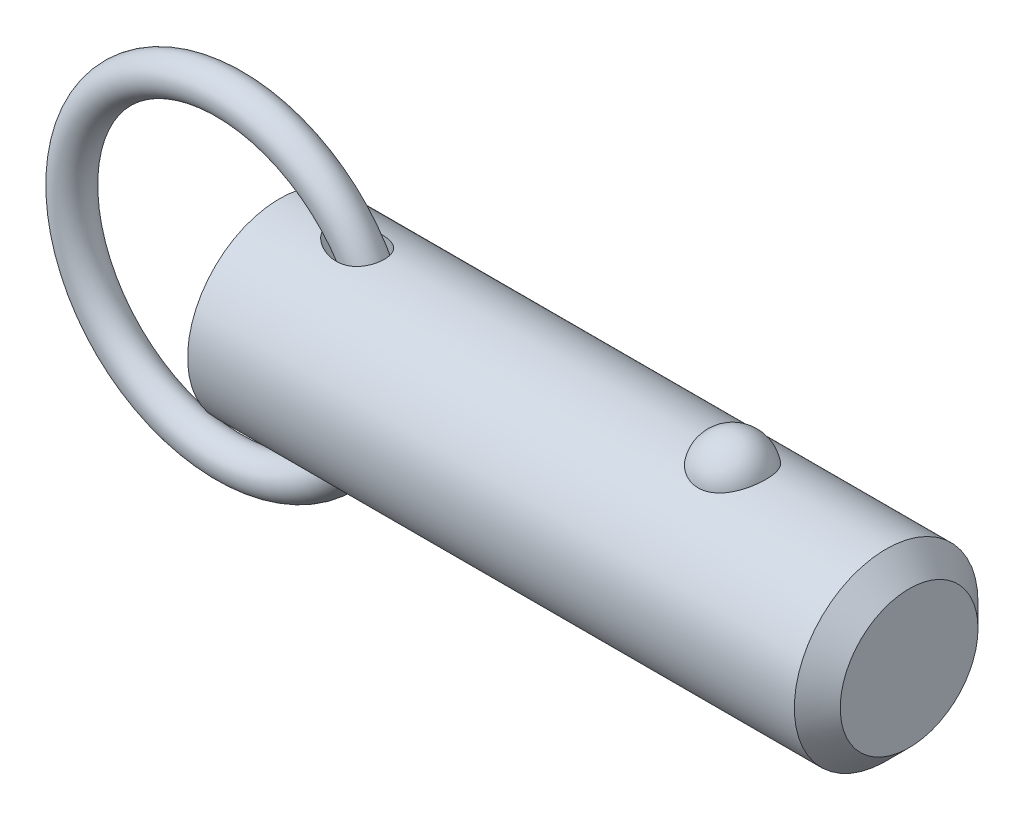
ISO-10303-21;
HEADER;
FILE_DESCRIPTION(('STEP AP214'),'2;1');
FILE_NAME('part.step','',(''),(''),'','','');
FILE_SCHEMA(('AUTOMOTIVE_DESIGN { 1 0 10303 214 1 1 1 1 }'));
ENDSEC;
DATA;
#1=APPLICATION_CONTEXT('core data for automotive mechanical design processes');
#2=APPLICATION_PROTOCOL_DEFINITION('international standard','automotive_design',2000,#1);
#3=PRODUCT_CONTEXT('',#1,'mechanical');
#4=PRODUCT('Part','Part','',(#3));
#5=PRODUCT_RELATED_PRODUCT_CATEGORY('part','',(#4));
#6=PRODUCT_DEFINITION_FORMATION('','',#4);
#7=PRODUCT_DEFINITION_CONTEXT('part definition',#1,'design');
#8=PRODUCT_DEFINITION('design','',#6,#7);
#9=PRODUCT_DEFINITION_SHAPE('','',#8);
#10=(LENGTH_UNIT() NAMED_UNIT(*) SI_UNIT(.MILLI.,.METRE.));
#11=(NAMED_UNIT(*) PLANE_ANGLE_UNIT() SI_UNIT($,.RADIAN.));
#12=(NAMED_UNIT(*) SI_UNIT($,.STERADIAN.) SOLID_ANGLE_UNIT());
#13=UNCERTAINTY_MEASURE_WITH_UNIT(LENGTH_MEASURE(1.E-05),#10,'distance_accuracy_value','');
#14=(GEOMETRIC_REPRESENTATION_CONTEXT(3) GLOBAL_UNCERTAINTY_ASSIGNED_CONTEXT((#13)) GLOBAL_UNIT_ASSIGNED_CONTEXT((#10,
#11,#12)) REPRESENTATION_CONTEXT('',''));
#15=CARTESIAN_POINT('',(0.,0.,0.));
#16=DIRECTION('',(0.,0.,1.));
#17=DIRECTION('',(1.,0.,0.));
#18=AXIS2_PLACEMENT_3D('',#15,#16,#17);
#19=CARTESIAN_POINT('',(-6.08699288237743,0.,0.));
#20=DIRECTION('',(0.,0.,1.));
#21=DIRECTION('',(1.,0.,0.));
#22=AXIS2_PLACEMENT_3D('',#19,#20,#21);
#23=TOROIDAL_SURFACE('',#22,19.05,2.223);
#24=CARTESIAN_POINT('',(15.1860071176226,0.,0.));
#25=VERTEX_POINT('',#24);
#26=VERTEX_LOOP('',#25);
#27=FACE_BOUND('',#26,.T.);
#28=ADVANCED_FACE('P0_F12',(#27),#23,.T.);
#29=CLOSED_SHELL('',(#28));
#30=MANIFOLD_SOLID_BREP('P0_B1',#29);
#31=CARTESIAN_POINT('',(0.,0.,0.));
#32=DIRECTION('',(1.,0.,0.));
#33=DIRECTION('',(0.,0.,-1.));
#34=AXIS2_PLACEMENT_3D('',#31,#32,#33);
#35=CYLINDRICAL_SURFACE('',#34,11.115);
#36=CARTESIAN_POINT('',(6.414051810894,11.0227946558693,-1.4287136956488));
#37=CARTESIAN_POINT('',(6.49338916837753,11.0115377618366,-1.51556642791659));
#38=CARTESIAN_POINT('',(6.57765461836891,10.9998263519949,-1.59789397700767));
#39=CARTESIAN_POINT('',(6.75386647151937,10.9760304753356,-1.75391400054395));
#40=CARTESIAN_POINT('',(6.84582247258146,10.9639455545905,-1.82759540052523));
#41=CARTESIAN_POINT('',(7.03627827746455,10.9397989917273,-1.96698954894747));
#42=CARTESIAN_POINT('',(7.13480838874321,10.9277377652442,-2.03266078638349));
#43=CARTESIAN_POINT('',(7.33681032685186,10.9041015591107,-2.1558582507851));
#44=CARTESIAN_POINT('',(7.44028007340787,10.8925263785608,-2.21338786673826));
#45=CARTESIAN_POINT('',(7.64386117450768,10.8710104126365,-2.31666528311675));
#46=CARTESIAN_POINT('',(7.74368989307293,10.8610119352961,-2.36295942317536));
#47=CARTESIAN_POINT('',(7.94637195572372,10.8420168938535,-2.44863486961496));
#48=CARTESIAN_POINT('',(8.04922612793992,10.8330206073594,-2.48801426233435));
#49=CARTESIAN_POINT('',(8.36115573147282,10.807980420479,-2.59542730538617));
#50=CARTESIAN_POINT('',(8.57411849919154,10.7938278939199,-2.65299817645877));
#51=CARTESIAN_POINT('',(9.00825016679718,10.7725818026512,-2.73800108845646));
#52=CARTESIAN_POINT('',(9.22947335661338,10.7655491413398,-2.76517330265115));
#53=CARTESIAN_POINT('',(9.67368141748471,10.7605872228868,-2.78445308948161));
#54=CARTESIAN_POINT('',(9.89666486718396,10.7626512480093,-2.77658653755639));
#55=CARTESIAN_POINT('',(10.2950172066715,10.7754452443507,-2.72644436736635));
#56=CARTESIAN_POINT('',(10.4712789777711,10.7844280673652,-2.69109376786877));
#57=CARTESIAN_POINT('',(10.7292776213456,10.8024982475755,-2.61722365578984));
#58=CARTESIAN_POINT('',(10.8142337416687,10.8092901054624,-2.58911576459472));
#59=CARTESIAN_POINT('',(10.9813218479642,10.8242580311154,-2.52581287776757));
#60=CARTESIAN_POINT('',(11.0634550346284,10.8324335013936,-2.49062094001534));
#61=CARTESIAN_POINT('',(11.2247418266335,10.8500287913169,-2.41281958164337));
#62=CARTESIAN_POINT('',(11.3038694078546,10.8594572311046,-2.37015806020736));
#63=CARTESIAN_POINT('',(11.4576781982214,10.8792243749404,-2.27770403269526));
#64=CARTESIAN_POINT('',(11.5323615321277,10.8895626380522,-2.22791497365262));
#65=CARTESIAN_POINT('',(11.6765388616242,10.9108113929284,-2.12140590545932));
#66=CARTESIAN_POINT('',(11.7460329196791,10.9217218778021,-2.064685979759));
#67=CARTESIAN_POINT('',(11.8790597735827,10.9437207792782,-1.94471764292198));
#68=CARTESIAN_POINT('',(11.9425932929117,10.9548091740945,-1.88147002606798));
#69=CARTESIAN_POINT('',(12.109388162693,10.9851999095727,-1.69784918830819));
#70=CARTESIAN_POINT('',(12.205655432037,11.0042655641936,-1.57093023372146));
#71=CARTESIAN_POINT('',(12.374151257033,11.0393391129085,-1.3017676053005));
#72=CARTESIAN_POINT('',(12.4463875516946,11.0553479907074,-1.15952888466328));
#73=CARTESIAN_POINT('',(12.5615818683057,11.0816338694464,-0.871972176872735));
#74=CARTESIAN_POINT('',(12.6058896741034,11.0921698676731,-0.727217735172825));
#75=CARTESIAN_POINT('',(12.6699315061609,11.1075802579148,-0.432089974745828));
#76=CARTESIAN_POINT('',(12.6896681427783,11.1124552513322,-0.281717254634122));
#77=CARTESIAN_POINT('',(12.704022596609,11.1159901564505,0.0188164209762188));
#78=CARTESIAN_POINT('',(12.6988836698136,11.1147102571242,0.168965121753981));
#79=CARTESIAN_POINT('',(12.6641681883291,11.1062126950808,0.466238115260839));
#80=CARTESIAN_POINT('',(12.6345920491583,11.0989951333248,0.613362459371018));
#81=CARTESIAN_POINT('',(12.5517453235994,11.0794095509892,0.900330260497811));
#82=CARTESIAN_POINT('',(12.4984878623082,11.0670443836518,1.0401777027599));
#83=CARTESIAN_POINT('',(12.3696588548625,11.0385082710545,1.308745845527));
#84=CARTESIAN_POINT('',(12.2940887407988,11.0223375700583,1.43746725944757));
#85=CARTESIAN_POINT('',(12.122380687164,10.987872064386,1.68079704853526));
#86=CARTESIAN_POINT('',(12.0261637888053,10.969569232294,1.79534850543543));
#87=CARTESIAN_POINT('',(11.8161707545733,10.932836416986,2.00695695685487));
#88=CARTESIAN_POINT('',(11.7023941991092,10.9144064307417,2.10401353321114));
#89=CARTESIAN_POINT('',(11.4575656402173,10.8788057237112,2.28105326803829));
#90=CARTESIAN_POINT('',(11.3261451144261,10.8616794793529,2.36053412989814));
#91=CARTESIAN_POINT('',(11.0523589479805,10.8308019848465,2.49839044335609));
#92=CARTESIAN_POINT('',(10.9099908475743,10.8170514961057,2.55676113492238));
#93=CARTESIAN_POINT('',(10.6060622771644,10.7929728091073,2.65666105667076));
#94=CARTESIAN_POINT('',(10.4438877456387,10.7830209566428,2.69640163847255));
#95=CARTESIAN_POINT('',(10.1154037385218,10.7687230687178,2.75293129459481));
#96=CARTESIAN_POINT('',(9.94909141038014,10.7643810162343,2.76970406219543));
#97=CARTESIAN_POINT('',(9.54387061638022,10.7604809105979,2.7848723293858));
#98=CARTESIAN_POINT('',(9.30446860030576,10.7637793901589,2.77227753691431));
#99=CARTESIAN_POINT('',(8.94961255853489,10.7757341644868,2.72524141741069));
#100=CARTESIAN_POINT('',(8.83186896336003,10.7808994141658,2.70482239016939));
#101=CARTESIAN_POINT('',(8.59835142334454,10.7932548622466,2.65509992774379));
#102=CARTESIAN_POINT('',(8.48257728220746,10.8004448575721,2.62579738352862));
#103=CARTESIAN_POINT('',(8.25208469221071,10.8166382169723,2.55827624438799));
#104=CARTESIAN_POINT('',(8.13740214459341,10.8256649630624,2.51994155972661));
#105=CARTESIAN_POINT('',(7.91132058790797,10.8451170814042,2.43486475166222));
#106=CARTESIAN_POINT('',(7.79992154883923,10.8555424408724,2.38812270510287));
#107=CARTESIAN_POINT('',(7.58115677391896,10.8774251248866,2.28638483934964));
#108=CARTESIAN_POINT('',(7.47378802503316,10.8888816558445,2.23139534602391));
#109=CARTESIAN_POINT('',(7.26385624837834,10.9124540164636,2.1131026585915));
#110=CARTESIAN_POINT('',(7.16129168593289,10.9245696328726,2.04980214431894));
#111=CARTESIAN_POINT('',(6.91882218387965,10.9543689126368,1.88540538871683));
#112=CARTESIAN_POINT('',(6.78193778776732,10.9721958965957,1.77979827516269));
#113=CARTESIAN_POINT('',(6.5247244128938,11.0070222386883,1.54989693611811));
#114=CARTESIAN_POINT('',(6.40436902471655,11.0240228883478,1.42563320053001));
#115=CARTESIAN_POINT('',(6.21838804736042,11.0509658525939,1.19529359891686));
#116=CARTESIAN_POINT('',(6.14691885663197,11.0615430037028,1.09404520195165));
#117=CARTESIAN_POINT('',(6.02043496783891,11.0805004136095,0.881508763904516));
#118=CARTESIAN_POINT('',(5.96539400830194,11.0888841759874,0.770237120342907));
#119=CARTESIAN_POINT('',(5.88475453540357,11.1012553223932,0.560577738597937));
#120=CARTESIAN_POINT('',(5.85559643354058,11.1057686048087,0.463603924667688));
#121=CARTESIAN_POINT('',(5.81381299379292,11.1122523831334,0.266083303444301));
#122=CARTESIAN_POINT('',(5.80117118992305,11.1142254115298,0.165540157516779));
#123=CARTESIAN_POINT('',(5.79363815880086,11.1153999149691,-0.0364747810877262));
#124=CARTESIAN_POINT('',(5.79878799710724,11.1145949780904,-0.137948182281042));
#125=CARTESIAN_POINT('',(5.82639592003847,11.1102987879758,-0.338493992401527));
#126=CARTESIAN_POINT('',(5.84887234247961,11.1068046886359,-0.437563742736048));
#127=CARTESIAN_POINT('',(5.91510741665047,11.0965857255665,-0.649968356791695));
#128=CARTESIAN_POINT('',(5.96220905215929,11.0893566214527,-0.762222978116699));
#129=CARTESIAN_POINT('',(6.0737844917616,11.072471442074,-0.977396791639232));
#130=CARTESIAN_POINT('',(6.13826787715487,11.0628140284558,-1.08031079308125));
#131=CARTESIAN_POINT('',(6.24101077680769,11.0477136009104,-1.22195806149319));
#132=CARTESIAN_POINT('',(6.27403486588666,11.042895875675,-1.26469183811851));
#133=CARTESIAN_POINT('',(6.34238022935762,11.0330152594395,-1.34817011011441));
#134=CARTESIAN_POINT('',(6.37769867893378,11.0279526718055,-1.38891694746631));
#135=CARTESIAN_POINT('',(6.414051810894,11.0227946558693,-1.4287136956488));
#136=B_SPLINE_CURVE_WITH_KNOTS('',3,(#36,#37,#38,#39,#40,#41,#42,#43,#44,#45,#46,#47,#48,#49,
#50,#51,#52,#53,#54,#55,#56,#57,#58,#59,#60,#61,#62,#63,#64,#65,#66,#67,#68,#69,#70,#71,#72,#73,
#74,#75,#76,#77,#78,#79,#80,#81,#82,#83,#84,#85,#86,#87,#88,#89,#90,#91,#92,#93,#94,#95,#96,#97,
#98,#99,#100,#101,#102,#103,#104,#105,#106,#107,#108,#109,#110,#111,#112,#113,#114,#115,#116,
#117,#118,#119,#120,#121,#122,#123,#124,#125,#126,#127,#128,#129,#130,#131,#132,#133,#134,#135),
.UNSPECIFIED.,.T.,.F.,(4,2,2,2,2,2,2,2,2,2,2,2,2,2,2,2,2,2,2,2,2,2,2,2,2,2,2,2,2,2,2,2,2,2,2,2,
2,2,2,2,2,2,2,2,2,2,2,2,2,4),(0.,0.354433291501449,0.709315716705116,1.0659654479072,
1.42246628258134,1.7536715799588,2.08496839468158,2.74582009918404,3.41227815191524,
4.07824412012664,4.61583787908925,4.88478112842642,5.1536085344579,5.42439170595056,
5.69504436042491,5.96569375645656,6.23631025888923,6.71490729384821,7.19335005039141,
7.64641437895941,8.09943057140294,8.54802575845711,8.99661331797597,9.44495256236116,
9.89326303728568,10.3433195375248,10.7933867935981,11.2550086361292,11.7167345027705,
12.2165866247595,12.7167934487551,13.4318876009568,13.7904664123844,14.1490092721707,
14.5124394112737,14.8758662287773,15.239015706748,15.6020483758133,16.1219860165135,
16.6410830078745,17.0130520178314,17.3844231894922,17.6872330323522,17.9897407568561,
18.2929471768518,18.5964749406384,18.9603532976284,19.3244326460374,19.4870338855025,
19.649438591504),.UNSPECIFIED.);
#137=CARTESIAN_POINT('',(6.414051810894,11.0227946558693,-1.4287136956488));
#138=VERTEX_POINT('',#137);
#139=EDGE_CURVE('P1_E40',#138,#138,#136,.T.);
#140=ORIENTED_EDGE('',*,*,#139,.T.);
#141=EDGE_LOOP('',(#140));
#142=FACE_BOUND('',#141,.T.);
#143=CARTESIAN_POINT('',(73.42125,0.,0.));
#144=DIRECTION('',(1.,0.,0.));
#145=DIRECTION('',(0.,0.,-1.));
#146=AXIS2_PLACEMENT_3D('',#143,#144,#145);
#147=CIRCLE('',#146,11.115);
#148=CARTESIAN_POINT('',(73.42125,0.,-11.115));
#149=VERTEX_POINT('',#148);
#150=EDGE_CURVE('P1_E25',#149,#149,#147,.T.);
#151=ORIENTED_EDGE('',*,*,#150,.F.);
#152=EDGE_LOOP('',(#151));
#153=FACE_BOUND('',#152,.T.);
#154=CARTESIAN_POINT('',(0.,0.,0.));
#155=DIRECTION('',(1.,0.,0.));
#156=DIRECTION('',(0.,0.,-1.));
#157=AXIS2_PLACEMENT_3D('',#154,#155,#156);
#158=CIRCLE('',#157,11.115);
#159=CARTESIAN_POINT('',(0.,0.,-11.115));
#160=VERTEX_POINT('',#159);
#161=EDGE_CURVE('P1_E9',#160,#160,#158,.T.);
#162=ORIENTED_EDGE('',*,*,#161,.T.);
#163=EDGE_LOOP('',(#162));
#164=FACE_BOUND('',#163,.T.);
#165=CARTESIAN_POINT('',(54.8310680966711,10.3028087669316,4.17077409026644));
#166=CARTESIAN_POINT('',(54.6147756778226,10.3028003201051,4.17078240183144));
#167=CARTESIAN_POINT('',(54.3985488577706,10.3098895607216,4.15340593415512));
#168=CARTESIAN_POINT('',(53.9725408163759,10.3373834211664,4.08449540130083));
#169=CARTESIAN_POINT('',(53.7627577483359,10.3577841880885,4.03297121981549));
#170=CARTESIAN_POINT('',(53.3557825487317,10.4095237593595,3.89746513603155));
#171=CARTESIAN_POINT('',(53.1585726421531,10.4408466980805,3.8135302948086));
#172=CARTESIAN_POINT('',(52.7813382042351,10.5110236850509,3.61560339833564));
#173=CARTESIAN_POINT('',(52.6013171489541,10.5498792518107,3.50160528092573));
#174=CARTESIAN_POINT('',(52.2576842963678,10.6322884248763,3.2429246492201));
#175=CARTESIAN_POINT('',(52.0946861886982,10.6759443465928,3.09746040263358));
#176=CARTESIAN_POINT('',(51.7945911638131,10.7625291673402,2.78171925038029));
#177=CARTESIAN_POINT('',(51.6574990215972,10.8054579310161,2.61143778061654));
#178=CARTESIAN_POINT('',(51.4064084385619,10.8881935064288,2.24226695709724));
#179=CARTESIAN_POINT('',(51.2937105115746,10.9277761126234,2.04244123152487));
#180=CARTESIAN_POINT('',(51.1017771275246,10.997484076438,1.62578254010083));
#181=CARTESIAN_POINT('',(51.022544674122,11.0276085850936,1.40894804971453));
#182=CARTESIAN_POINT('',(50.8983034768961,11.0756732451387,0.961250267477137));
#183=CARTESIAN_POINT('',(50.853760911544,11.0934470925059,0.730239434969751));
#184=CARTESIAN_POINT('',(50.8015695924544,11.1143331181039,0.263439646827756));
#185=CARTESIAN_POINT('',(50.7939200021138,11.1174456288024,0.0276507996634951));
#186=CARTESIAN_POINT('',(50.8156105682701,11.1087161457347,-0.440729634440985));
#187=CARTESIAN_POINT('',(50.8447624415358,11.0969502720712,-0.673331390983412));
#188=CARTESIAN_POINT('',(50.9391432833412,11.0597872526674,-1.12996621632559));
#189=CARTESIAN_POINT('',(51.0043729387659,11.0343898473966,-1.35399912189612));
#190=CARTESIAN_POINT('',(51.1696984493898,10.972515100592,-1.78750286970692));
#191=CARTESIAN_POINT('',(51.2698386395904,10.9360236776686,-1.99695478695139));
#192=CARTESIAN_POINT('',(51.5029408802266,10.8557595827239,-2.39520667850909));
#193=CARTESIAN_POINT('',(51.6359054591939,10.8119863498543,-2.5840050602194));
#194=CARTESIAN_POINT('',(51.932407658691,10.7216733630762,-2.93635726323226));
#195=CARTESIAN_POINT('',(52.0960565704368,10.675123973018,-3.09981510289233));
#196=CARTESIAN_POINT('',(52.4498601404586,10.5846571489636,-3.39592247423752));
#197=CARTESIAN_POINT('',(52.6400123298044,10.5407394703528,-3.52857487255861));
#198=CARTESIAN_POINT('',(53.0375014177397,10.4616690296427,-3.75646057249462));
#199=CARTESIAN_POINT('',(53.2443670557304,10.4263443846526,-3.8524543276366));
#200=CARTESIAN_POINT('',(53.6729541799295,10.3675574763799,-4.00798747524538));
#201=CARTESIAN_POINT('',(53.894670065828,10.344090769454,-4.0675405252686));
#202=CARTESIAN_POINT('',(54.3346695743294,10.3128282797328,-4.14614314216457));
#203=CARTESIAN_POINT('',(54.5525654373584,10.3043040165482,-4.16707833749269));
#204=CARTESIAN_POINT('',(54.98894951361,10.3016771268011,-4.17357158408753));
#205=CARTESIAN_POINT('',(55.2074376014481,10.3075716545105,-4.15913661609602));
#206=CARTESIAN_POINT('',(55.6317442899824,10.3326686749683,-4.09636961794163));
#207=CARTESIAN_POINT('',(55.8377458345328,10.3514555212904,-4.0490957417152));
#208=CARTESIAN_POINT('',(56.2385764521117,10.399818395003,-3.92320197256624));
#209=CARTESIAN_POINT('',(56.4334046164,10.4293952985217,-3.84457953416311));
#210=CARTESIAN_POINT('',(56.8111917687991,10.4969600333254,-3.65612410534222));
#211=CARTESIAN_POINT('',(56.9937974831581,10.5351178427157,-3.54564545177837));
#212=CARTESIAN_POINT('',(57.3382040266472,10.6154999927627,-3.29718036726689));
#213=CARTESIAN_POINT('',(57.500000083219,10.657725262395,-3.15918764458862));
#214=CARTESIAN_POINT('',(57.8069596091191,10.744212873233,-2.85163580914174));
#215=CARTESIAN_POINT('',(57.9508919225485,10.7884718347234,-2.68084605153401));
#216=CARTESIAN_POINT('',(58.2092371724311,10.872374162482,-2.3172186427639));
#217=CARTESIAN_POINT('',(58.3236448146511,10.9120167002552,-2.12437704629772));
#218=CARTESIAN_POINT('',(58.5238739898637,10.9838919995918,-1.71516999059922));
#219=CARTESIAN_POINT('',(58.6086617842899,11.0158465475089,-1.498248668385));
#220=CARTESIAN_POINT('',(58.7426838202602,11.0673523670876,-1.052285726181));
#221=CARTESIAN_POINT('',(58.7919174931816,11.086903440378,-0.823243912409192));
#222=CARTESIAN_POINT('',(58.8538915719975,11.1116323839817,-0.359087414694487));
#223=CARTESIAN_POINT('',(58.8665662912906,11.1167843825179,-0.123962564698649));
#224=CARTESIAN_POINT('',(58.854973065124,11.1121144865,0.345220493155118));
#225=CARTESIAN_POINT('',(58.8307056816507,11.1022928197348,0.579278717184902));
#226=CARTESIAN_POINT('',(58.7459073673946,11.0687504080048,1.03866534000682));
#227=CARTESIAN_POINT('',(58.6855299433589,11.0450885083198,1.26402641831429));
#228=CARTESIAN_POINT('',(58.5298532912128,10.9863185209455,1.70076772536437));
#229=CARTESIAN_POINT('',(58.434551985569,10.9512097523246,1.91214712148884));
#230=CARTESIAN_POINT('',(58.2103974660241,10.8729733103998,2.31608359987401));
#231=CARTESIAN_POINT('',(58.0813806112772,10.8298068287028,2.50854240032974));
#232=CARTESIAN_POINT('',(57.7927327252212,10.7401896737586,2.86808766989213));
#233=CARTESIAN_POINT('',(57.6331022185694,10.6937390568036,3.03517457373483));
#234=CARTESIAN_POINT('',(57.2875341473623,10.6029321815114,3.33857581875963));
#235=CARTESIAN_POINT('',(57.1017089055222,10.5585680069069,3.47501541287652));
#236=CARTESIAN_POINT('',(56.7078750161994,10.4769321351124,3.71390897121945));
#237=CARTESIAN_POINT('',(56.4998635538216,10.439661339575,3.81635861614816));
#238=CARTESIAN_POINT('',(56.0540666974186,10.3749407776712,3.98910631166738));
#239=CARTESIAN_POINT('',(55.8152342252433,10.3482457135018,4.05700929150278));
#240=CARTESIAN_POINT('',(55.3279254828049,10.312188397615,4.14782844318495));
#241=CARTESIAN_POINT('',(55.0794535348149,10.3028184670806,4.17076454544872));
#242=CARTESIAN_POINT('',(54.8310680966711,10.3028087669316,4.17077409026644));
#243=B_SPLINE_CURVE_WITH_KNOTS('',3,(#165,#166,#167,#168,#169,#170,#171,#172,#173,#174,#175,
#176,#177,#178,#179,#180,#181,#182,#183,#184,#185,#186,#187,#188,#189,#190,#191,#192,#193,#194,
#195,#196,#197,#198,#199,#200,#201,#202,#203,#204,#205,#206,#207,#208,#209,#210,#211,#212,#213,
#214,#215,#216,#217,#218,#219,#220,#221,#222,#223,#224,#225,#226,#227,#228,#229,#230,#231,#232,
#233,#234,#235,#236,#237,#238,#239,#240,#241,#242),.UNSPECIFIED.,.T.,.F.,(4,2,2,2,2,2,2,2,2,2,2,
2,2,2,2,2,2,2,2,2,2,2,2,2,2,2,2,2,2,2,2,2,2,2,2,2,2,2,4),(0.,0.647966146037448,1.29574482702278,
1.94258643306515,2.58955857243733,3.25496465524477,3.92049326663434,4.61566368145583,
5.31089647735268,6.01531821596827,6.71972398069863,7.42054043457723,8.12137023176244,
8.8230933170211,9.52487047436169,10.2292439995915,10.9335519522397,11.6223330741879,
12.3108558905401,12.9647664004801,13.6185478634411,14.252184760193,14.8858731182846,
15.5334360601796,16.1811472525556,16.8611459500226,17.5412664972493,18.2431855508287,
18.9451158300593,19.6483065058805,20.3514864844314,21.0516982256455,21.7519516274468,
22.4556690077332,23.1593743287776,23.860149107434,24.5610129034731,25.3054529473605,
26.049562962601),.UNSPECIFIED.);
#244=CARTESIAN_POINT('',(54.8310680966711,10.3028087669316,4.17077409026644));
#245=VERTEX_POINT('',#244);
#246=EDGE_CURVE('P1_E34',#245,#245,#243,.T.);
#247=ORIENTED_EDGE('',*,*,#246,.T.);
#248=EDGE_LOOP('',(#247));
#249=FACE_BOUND('',#248,.T.);
#250=CARTESIAN_POINT('',(6.414051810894,-11.0227946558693,-1.4287136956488));
#251=CARTESIAN_POINT('',(6.3312406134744,-11.0345445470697,-1.33806125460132));
#252=CARTESIAN_POINT('',(6.25372866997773,-11.0458090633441,-1.24240732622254));
#253=CARTESIAN_POINT('',(6.11277905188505,-11.0666115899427,-1.04095704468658));
#254=CARTESIAN_POINT('',(6.04933920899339,-11.0761498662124,-0.935162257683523));
#255=CARTESIAN_POINT('',(5.94029181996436,-11.0927063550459,-0.71247649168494));
#256=CARTESIAN_POINT('',(5.89492964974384,-11.0996897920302,-0.595457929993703));
#257=CARTESIAN_POINT('',(5.8449816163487,-11.1074141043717,-0.414997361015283));
#258=CARTESIAN_POINT('',(5.83135004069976,-11.1095300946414,-0.354047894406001));
#259=CARTESIAN_POINT('',(5.81051649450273,-11.1127688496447,-0.231041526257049));
#260=CARTESIAN_POINT('',(5.80331311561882,-11.1138918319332,-0.1689848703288));
#261=CARTESIAN_POINT('',(5.7929652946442,-11.1155042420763,-0.00048481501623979));
#262=CARTESIAN_POINT('',(5.79625267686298,-11.1149904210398,0.106437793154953));
#263=CARTESIAN_POINT('',(5.82213676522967,-11.1109609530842,0.317809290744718));
#264=CARTESIAN_POINT('',(5.84474662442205,-11.1074432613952,0.422256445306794));
#265=CARTESIAN_POINT('',(5.91113114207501,-11.097197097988,0.63936180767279));
#266=CARTESIAN_POINT('',(5.95733120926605,-11.090102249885,0.751250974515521));
#267=CARTESIAN_POINT('',(6.06709542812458,-11.0734770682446,0.965912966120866));
#268=CARTESIAN_POINT('',(6.13068735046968,-11.06394284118,1.06867085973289));
#269=CARTESIAN_POINT('',(6.30294237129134,-11.0385920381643,1.30890635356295));
#270=CARTESIAN_POINT('',(6.41896200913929,-11.0218881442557,1.44097376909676));
#271=CARTESIAN_POINT('',(6.66989654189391,-10.9871512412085,1.68553954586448));
#272=CARTESIAN_POINT('',(6.80485520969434,-10.9691152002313,1.79799117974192));
#273=CARTESIAN_POINT('',(7.04881236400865,-10.9382283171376,1.97587596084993));
#274=CARTESIAN_POINT('',(7.15465712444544,-10.9253240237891,2.04570822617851));
#275=CARTESIAN_POINT('',(7.37202504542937,-10.9000987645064,2.17611840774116));
#276=CARTESIAN_POINT('',(7.48355057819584,-10.8877780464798,2.23669241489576));
#277=CARTESIAN_POINT('',(7.71132418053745,-10.8641580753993,2.34873831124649));
#278=CARTESIAN_POINT('',(7.82757727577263,-10.8528599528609,2.40020018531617));
#279=CARTESIAN_POINT('',(8.0638682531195,-10.8317234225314,2.49385169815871));
#280=CARTESIAN_POINT('',(8.18390558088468,-10.8218848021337,2.53604268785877));
#281=CARTESIAN_POINT('',(8.42918336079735,-10.8039208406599,2.61152283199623));
#282=CARTESIAN_POINT('',(8.55447802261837,-10.7958283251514,2.64464414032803));
#283=CARTESIAN_POINT('',(8.8075212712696,-10.781995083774,2.70048793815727));
#284=CARTESIAN_POINT('',(8.93527019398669,-10.7762546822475,2.72320899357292));
#285=CARTESIAN_POINT('',(9.19210176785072,-10.7675291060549,2.75750994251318));
#286=CARTESIAN_POINT('',(9.32118105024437,-10.7645381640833,2.76911315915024));
#287=CARTESIAN_POINT('',(9.57984338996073,-10.761622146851,2.78042035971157));
#288=CARTESIAN_POINT('',(9.70942621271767,-10.7616957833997,2.78012934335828));
#289=CARTESIAN_POINT('',(10.0243125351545,-10.7659059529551,2.76381534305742));
#290=CARTESIAN_POINT('',(10.209307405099,-10.7717977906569,2.74099674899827));
#291=CARTESIAN_POINT('',(10.5731188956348,-10.7905408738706,2.66626238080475));
#292=CARTESIAN_POINT('',(10.7519389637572,-10.8033881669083,2.61436313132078));
#293=CARTESIAN_POINT('',(11.0114289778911,-10.8271584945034,2.51336808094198));
#294=CARTESIAN_POINT('',(11.096831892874,-10.835881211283,2.47562331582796));
#295=CARTESIAN_POINT('',(11.2636000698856,-10.8545688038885,2.39236170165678));
#296=CARTESIAN_POINT('',(11.3449673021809,-10.8645330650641,2.3468486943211));
#297=CARTESIAN_POINT('',(11.5027832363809,-10.8853818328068,2.24815967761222));
#298=CARTESIAN_POINT('',(11.5792327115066,-10.8962661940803,2.19498487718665));
#299=CARTESIAN_POINT('',(11.7263315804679,-10.9185541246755,2.08128855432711));
#300=CARTESIAN_POINT('',(11.7969818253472,-10.9299576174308,2.02076811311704));
#301=CARTESIAN_POINT('',(11.9817953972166,-10.9613645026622,1.84513663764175));
#302=CARTESIAN_POINT('',(12.0893012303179,-10.9814643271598,1.72286660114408));
#303=CARTESIAN_POINT('',(12.2803576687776,-11.0193991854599,1.46066991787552));
#304=CARTESIAN_POINT('',(12.3639173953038,-11.0372350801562,1.32075002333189));
#305=CARTESIAN_POINT('',(12.4996220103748,-11.0672969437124,1.03778067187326));
#306=CARTESIAN_POINT('',(12.5535315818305,-11.0798242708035,0.895607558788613));
#307=CARTESIAN_POINT('',(12.636874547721,-11.0995427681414,0.603918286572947));
#308=CARTESIAN_POINT('',(12.6663115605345,-11.1067347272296,0.45440321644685));
#309=CARTESIAN_POINT('',(12.6997387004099,-11.1149224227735,0.154577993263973));
#310=CARTESIAN_POINT('',(12.7040886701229,-11.1160057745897,0.00431019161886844));
#311=CARTESIAN_POINT('',(12.6882048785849,-11.1120956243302,-0.294841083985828));
#312=CARTESIAN_POINT('',(12.6679715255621,-11.1071022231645,-0.443724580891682));
#313=CARTESIAN_POINT('',(12.6034470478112,-11.0915888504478,-0.735688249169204));
#314=CARTESIAN_POINT('',(12.5591858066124,-11.0810757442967,-0.878775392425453));
#315=CARTESIAN_POINT('',(12.4477416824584,-11.0556687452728,-1.15529525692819));
#316=CARTESIAN_POINT('',(12.3805601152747,-11.0407751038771,-1.2887285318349));
#317=CARTESIAN_POINT('',(12.2248919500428,-11.0081839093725,-1.54257976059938));
#318=CARTESIAN_POINT('',(12.1363549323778,-10.9904797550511,-1.66296592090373));
#319=CARTESIAN_POINT('',(11.9406137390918,-10.9541951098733,-1.88726577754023));
#320=CARTESIAN_POINT('',(11.833409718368,-10.9356146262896,-1.99117961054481));
#321=CARTESIAN_POINT('',(11.601318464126,-10.8991360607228,-2.18213646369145));
#322=CARTESIAN_POINT('',(11.4761325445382,-10.8812577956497,-2.26881927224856));
#323=CARTESIAN_POINT('',(11.2134852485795,-10.8482871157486,-2.42157282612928));
#324=CARTESIAN_POINT('',(11.0760218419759,-10.8331951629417,-2.48764015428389));
#325=CARTESIAN_POINT('',(10.7828968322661,-10.8061050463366,-2.60290068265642));
#326=CARTESIAN_POINT('',(10.6266338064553,-10.7943907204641,-2.65062248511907));
#327=CARTESIAN_POINT('',(10.3086617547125,-10.7762429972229,-2.72345054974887));
#328=CARTESIAN_POINT('',(10.146948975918,-10.7698133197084,-2.74854088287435));
#329=CARTESIAN_POINT('',(9.75541304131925,-10.7608036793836,-2.78368719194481));
#330=CARTESIAN_POINT('',(9.52459435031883,-10.7608467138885,-2.78350276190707));
#331=CARTESIAN_POINT('',(9.0660496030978,-10.7702674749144,-2.74677945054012));
#332=CARTESIAN_POINT('',(8.83832966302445,-10.7796615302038,-2.71017697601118));
#333=CARTESIAN_POINT('',(8.38783466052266,-10.8058248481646,-2.60392490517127));
#334=CARTESIAN_POINT('',(8.16517101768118,-10.8226939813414,-2.53382676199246));
#335=CARTESIAN_POINT('',(7.84087311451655,-10.8516548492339,-2.40555545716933));
#336=CARTESIAN_POINT('',(7.73435551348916,-10.8619221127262,-2.35892455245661));
#337=CARTESIAN_POINT('',(7.52510420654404,-10.883357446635,-2.25797017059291));
#338=CARTESIAN_POINT('',(7.42236986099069,-10.8945253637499,-2.20364800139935));
#339=CARTESIAN_POINT('',(7.23808758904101,-10.915528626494,-2.09688018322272));
#340=CARTESIAN_POINT('',(7.15584631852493,-10.9252787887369,-2.04561072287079));
#341=CARTESIAN_POINT('',(6.99510576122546,-10.944960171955,-1.93754729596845));
#342=CARTESIAN_POINT('',(6.91660574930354,-10.9548913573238,-1.88075440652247));
#343=CARTESIAN_POINT('',(6.76418133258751,-10.974690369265,-1.7615450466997));
#344=CARTESIAN_POINT('',(6.69024940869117,-10.9845582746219,-1.69913825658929));
#345=CARTESIAN_POINT('',(6.54780119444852,-11.0039826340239,-1.56842485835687));
#346=CARTESIAN_POINT('',(6.47928247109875,-11.0135392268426,-1.50012092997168));
#347=CARTESIAN_POINT('',(6.414051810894,-11.0227946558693,-1.4287136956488));
#348=B_SPLINE_CURVE_WITH_KNOTS('',3,(#250,#251,#252,#253,#254,#255,#256,#257,#258,#259,#260,
#261,#262,#263,#264,#265,#266,#267,#268,#269,#270,#271,#272,#273,#274,#275,#276,#277,#278,#279,
#280,#281,#282,#283,#284,#285,#286,#287,#288,#289,#290,#291,#292,#293,#294,#295,#296,#297,#298,
#299,#300,#301,#302,#303,#304,#305,#306,#307,#308,#309,#310,#311,#312,#313,#314,#315,#316,#317,
#318,#319,#320,#321,#322,#323,#324,#325,#326,#327,#328,#329,#330,#331,#332,#333,#334,#335,#336,
#337,#338,#339,#340,#341,#342,#343,#344,#345,#346,#347),.UNSPECIFIED.,.T.,.F.,(4,2,2,2,2,2,2,2,
2,2,2,2,2,2,2,2,2,2,2,2,2,2,2,2,2,2,2,2,2,2,2,2,2,2,2,2,2,2,2,2,2,2,2,2,2,2,2,2,4),(0.,
0.36983565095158,0.739614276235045,1.1142538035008,1.30141910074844,1.48854338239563,
1.8074587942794,2.12659146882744,2.4883888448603,2.85076733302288,3.3776216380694,
3.9057143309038,4.287639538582,4.66972556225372,5.05222896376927,5.43467659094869,
5.82378546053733,6.21294796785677,6.6012922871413,6.98947336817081,7.54669558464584,
8.10360148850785,8.3845853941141,8.66543074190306,8.94623182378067,9.22699162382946,
9.71628887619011,10.2053995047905,10.6608871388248,11.1163074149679,11.5651786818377,
12.0140424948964,12.4623493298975,12.9106304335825,13.3599804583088,13.8093267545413,
14.2672570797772,14.7252632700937,15.214740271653,15.7045615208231,16.3932594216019,
17.083162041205,17.7825738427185,18.1325177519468,18.4824022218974,18.7744056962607,
19.0663523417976,19.3578048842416,19.6491256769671),.UNSPECIFIED.);
#349=CARTESIAN_POINT('',(6.414051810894,-11.0227946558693,-1.4287136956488));
#350=VERTEX_POINT('',#349);
#351=EDGE_CURVE('P1_E17',#350,#350,#348,.T.);
#352=ORIENTED_EDGE('',*,*,#351,.T.);
#353=EDGE_LOOP('',(#352));
#354=FACE_BOUND('',#353,.T.);
#355=ADVANCED_FACE('P1_F13',(#142,#153,#164,#249,#354),#35,.T.);
#356=CARTESIAN_POINT('',(0.,0.,0.));
#357=DIRECTION('',(-1.,0.,0.));
#358=DIRECTION('',(0.,0.,1.));
#359=AXIS2_PLACEMENT_3D('',#356,#357,#358);
#360=PLANE('',#359);
#361=ORIENTED_EDGE('',*,*,#161,.F.);
#362=EDGE_LOOP('',(#361));
#363=FACE_BOUND('',#362,.T.);
#364=ADVANCED_FACE('P1_F15',(#363),#360,.T.);
#365=CARTESIAN_POINT('',(76.2,0.,0.));
#366=DIRECTION('',(-1.,0.,0.));
#367=DIRECTION('',(0.,0.,1.));
#368=AXIS2_PLACEMENT_3D('',#365,#366,#367);
#369=CONICAL_SURFACE('',#368,8.33625000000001,0.785398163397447);
#370=ORIENTED_EDGE('',*,*,#150,.T.);
#371=EDGE_LOOP('',(#370));
#372=FACE_BOUND('',#371,.T.);
#373=CARTESIAN_POINT('',(76.2,0.,0.));
#374=DIRECTION('',(1.,0.,0.));
#375=DIRECTION('',(0.,0.,-1.));
#376=AXIS2_PLACEMENT_3D('',#373,#374,#375);
#377=CIRCLE('',#376,8.33625000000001);
#378=CARTESIAN_POINT('',(76.2,0.,-8.33625000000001));
#379=VERTEX_POINT('',#378);
#380=EDGE_CURVE('P1_E30',#379,#379,#377,.T.);
#381=ORIENTED_EDGE('',*,*,#380,.F.);
#382=EDGE_LOOP('',(#381));
#383=FACE_BOUND('',#382,.T.);
#384=ADVANCED_FACE('P1_F55',(#372,#383),#369,.T.);
#385=CARTESIAN_POINT('',(76.2,8.33625000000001,0.));
#386=DIRECTION('',(1.,0.,0.));
#387=DIRECTION('',(0.,0.,-1.));
#388=AXIS2_PLACEMENT_3D('',#385,#386,#387);
#389=PLANE('',#388);
#390=ORIENTED_EDGE('',*,*,#380,.T.);
#391=EDGE_LOOP('',(#390));
#392=FACE_BOUND('',#391,.T.);
#393=ADVANCED_FACE('P1_F51',(#392),#389,.T.);
#394=CARTESIAN_POINT('',(54.8310680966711,10.0035,0.));
#395=DIRECTION('',(-1.,0.,0.));
#396=DIRECTION('',(0.,1.,0.));
#397=AXIS2_PLACEMENT_3D('',#394,#395,#396);
#398=SPHERICAL_SURFACE('',#397,4.1815);
#399=ORIENTED_EDGE('',*,*,#246,.F.);
#400=EDGE_LOOP('',(#399));
#401=FACE_BOUND('',#400,.T.);
#402=ADVANCED_FACE('P1_F46',(#401),#398,.T.);
#403=CARTESIAN_POINT('',(-6.08699288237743,0.,0.));
#404=DIRECTION('',(0.,0.,1.));
#405=DIRECTION('',(1.,0.,0.));
#406=AXIS2_PLACEMENT_3D('',#403,#404,#405);
#407=TOROIDAL_SURFACE('',#406,19.05,2.77875);
#408=ORIENTED_EDGE('',*,*,#351,.F.);
#409=EDGE_LOOP('',(#408));
#410=FACE_BOUND('',#409,.T.);
#411=ORIENTED_EDGE('',*,*,#139,.F.);
#412=EDGE_LOOP('',(#411));
#413=FACE_BOUND('',#412,.T.);
#414=ADVANCED_FACE('P1_F50',(#410,#413),#407,.F.);
#415=CLOSED_SHELL('',(#355,#364,#384,#393,#402,#414));
#416=MANIFOLD_SOLID_BREP('P1_B1',#415);
#417=ADVANCED_BREP_SHAPE_REPRESENTATION('',(#18,#30,#416),#14);
#418=SHAPE_DEFINITION_REPRESENTATION(#9,#417);
ENDSEC;
END-ISO-10303-21;
